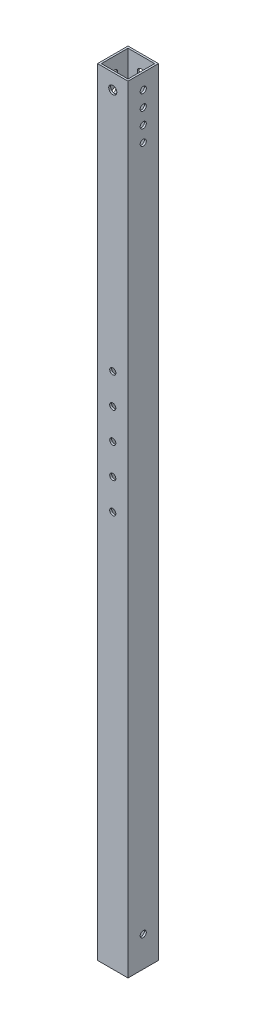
ISO-10303-21;
HEADER;
FILE_DESCRIPTION(('STEP AP214'),'2;1');
FILE_NAME('part.step','',(''),(''),'','','');
FILE_SCHEMA(('AUTOMOTIVE_DESIGN { 1 0 10303 214 1 1 1 1 }'));
ENDSEC;
DATA;
#1=APPLICATION_CONTEXT('core data for automotive mechanical design processes');
#2=APPLICATION_PROTOCOL_DEFINITION('international standard','automotive_design',2000,#1);
#3=PRODUCT_CONTEXT('',#1,'mechanical');
#4=PRODUCT('Part','Part','',(#3));
#5=PRODUCT_RELATED_PRODUCT_CATEGORY('part','',(#4));
#6=PRODUCT_DEFINITION_FORMATION('','',#4);
#7=PRODUCT_DEFINITION_CONTEXT('part definition',#1,'design');
#8=PRODUCT_DEFINITION('design','',#6,#7);
#9=PRODUCT_DEFINITION_SHAPE('','',#8);
#10=(LENGTH_UNIT() NAMED_UNIT(*) SI_UNIT(.MILLI.,.METRE.));
#11=(NAMED_UNIT(*) PLANE_ANGLE_UNIT() SI_UNIT($,.RADIAN.));
#12=(NAMED_UNIT(*) SI_UNIT($,.STERADIAN.) SOLID_ANGLE_UNIT());
#13=UNCERTAINTY_MEASURE_WITH_UNIT(LENGTH_MEASURE(1.E-05),#10,'distance_accuracy_value','');
#14=(GEOMETRIC_REPRESENTATION_CONTEXT(3) GLOBAL_UNCERTAINTY_ASSIGNED_CONTEXT((#13)) GLOBAL_UNIT_ASSIGNED_CONTEXT((#10,
#11,#12)) REPRESENTATION_CONTEXT('',''));
#15=CARTESIAN_POINT('',(0.,0.,0.));
#16=DIRECTION('',(0.,0.,1.));
#17=DIRECTION('',(1.,0.,0.));
#18=AXIS2_PLACEMENT_3D('',#15,#16,#17);
#19=CARTESIAN_POINT('',(-12.7,647.7,12.7));
#20=DIRECTION('',(0.,0.,-1.));
#21=DIRECTION('',(-1.,0.,0.));
#22=AXIS2_PLACEMENT_3D('',#19,#20,#21);
#23=PLANE('',#22);
#24=CARTESIAN_POINT('',(0.,635.,12.7));
#25=DIRECTION('',(0.,0.,-1.));
#26=DIRECTION('',(-1.,0.,0.));
#27=AXIS2_PLACEMENT_3D('',#24,#25,#26);
#28=CIRCLE('',#27,3.373501);
#29=CARTESIAN_POINT('',(-3.373501,635.,12.7));
#30=VERTEX_POINT('',#29);
#31=EDGE_CURVE('E789',#30,#30,#28,.T.);
#32=ORIENTED_EDGE('',*,*,#31,.T.);
#33=EDGE_LOOP('',(#32));
#34=FACE_BOUND('',#33,.T.);
#35=CARTESIAN_POINT('',(0.,330.2,12.7));
#36=DIRECTION('',(0.,0.,1.));
#37=DIRECTION('',(1.,0.,0.));
#38=AXIS2_PLACEMENT_3D('',#35,#36,#37);
#39=CIRCLE('',#38,2.5527);
#40=CARTESIAN_POINT('',(2.5527,330.2,12.7));
#41=VERTEX_POINT('',#40);
#42=EDGE_CURVE('E309',#41,#41,#39,.T.);
#43=ORIENTED_EDGE('',*,*,#42,.F.);
#44=EDGE_LOOP('',(#43));
#45=FACE_BOUND('',#44,.T.);
#46=CARTESIAN_POINT('',(0.,355.6,12.7));
#47=DIRECTION('',(0.,0.,1.));
#48=DIRECTION('',(1.,0.,0.));
#49=AXIS2_PLACEMENT_3D('',#46,#47,#48);
#50=CIRCLE('',#49,2.5527);
#51=CARTESIAN_POINT('',(2.5527,355.6,12.7));
#52=VERTEX_POINT('',#51);
#53=EDGE_CURVE('E319',#52,#52,#50,.T.);
#54=ORIENTED_EDGE('',*,*,#53,.F.);
#55=EDGE_LOOP('',(#54));
#56=FACE_BOUND('',#55,.T.);
#57=CARTESIAN_POINT('',(0.,381.,12.7));
#58=DIRECTION('',(0.,0.,1.));
#59=DIRECTION('',(1.,0.,0.));
#60=AXIS2_PLACEMENT_3D('',#57,#58,#59);
#61=CIRCLE('',#60,2.5527);
#62=CARTESIAN_POINT('',(2.5527,381.,12.7));
#63=VERTEX_POINT('',#62);
#64=EDGE_CURVE('E329',#63,#63,#61,.T.);
#65=ORIENTED_EDGE('',*,*,#64,.F.);
#66=EDGE_LOOP('',(#65));
#67=FACE_BOUND('',#66,.T.);
#68=CARTESIAN_POINT('',(0.,431.8,12.7));
#69=DIRECTION('',(0.,0.,1.));
#70=DIRECTION('',(1.,0.,0.));
#71=AXIS2_PLACEMENT_3D('',#68,#69,#70);
#72=CIRCLE('',#71,2.5527);
#73=CARTESIAN_POINT('',(2.5527,431.8,12.7));
#74=VERTEX_POINT('',#73);
#75=EDGE_CURVE('E349',#74,#74,#72,.T.);
#76=ORIENTED_EDGE('',*,*,#75,.F.);
#77=EDGE_LOOP('',(#76));
#78=FACE_BOUND('',#77,.T.);
#79=DIRECTION('',(1.,0.,0.));
#80=VECTOR('',#79,1.);
#81=CARTESIAN_POINT('',(-12.7,0.,12.7));
#82=LINE('',#81,#80);
#83=CARTESIAN_POINT('',(-12.7,0.,12.7));
#84=VERTEX_POINT('',#83);
#85=CARTESIAN_POINT('',(12.7,0.,12.7));
#86=VERTEX_POINT('',#85);
#87=EDGE_CURVE('E162',#84,#86,#82,.T.);
#88=ORIENTED_EDGE('',*,*,#87,.T.);
#89=DIRECTION('',(0.,-1.,0.));
#90=VECTOR('',#89,1.);
#91=CARTESIAN_POINT('',(12.7,647.7,12.7));
#92=LINE('',#91,#90);
#93=CARTESIAN_POINT('',(12.7,647.7,12.7));
#94=VERTEX_POINT('',#93);
#95=EDGE_CURVE('E171',#94,#86,#92,.T.);
#96=ORIENTED_EDGE('',*,*,#95,.F.);
#97=DIRECTION('',(1.,0.,0.));
#98=VECTOR('',#97,1.);
#99=CARTESIAN_POINT('',(-12.7,647.7,12.7));
#100=LINE('',#99,#98);
#101=CARTESIAN_POINT('',(-12.7,647.7,12.7));
#102=VERTEX_POINT('',#101);
#103=EDGE_CURVE('E168',#102,#94,#100,.T.);
#104=ORIENTED_EDGE('',*,*,#103,.F.);
#105=DIRECTION('',(0.,-1.,0.));
#106=VECTOR('',#105,1.);
#107=CARTESIAN_POINT('',(-12.7,647.7,12.7));
#108=LINE('',#107,#106);
#109=EDGE_CURVE('E186',#102,#84,#108,.T.);
#110=ORIENTED_EDGE('',*,*,#109,.T.);
#111=EDGE_LOOP('',(#88,#96,#104,#110));
#112=FACE_BOUND('',#111,.T.);
#113=CARTESIAN_POINT('',(0.,406.4,12.7));
#114=DIRECTION('',(0.,0.,1.));
#115=DIRECTION('',(1.,0.,0.));
#116=AXIS2_PLACEMENT_3D('',#113,#114,#115);
#117=CIRCLE('',#116,2.5527);
#118=CARTESIAN_POINT('',(2.5527,406.4,12.7));
#119=VERTEX_POINT('',#118);
#120=EDGE_CURVE('E339',#119,#119,#117,.T.);
#121=ORIENTED_EDGE('',*,*,#120,.F.);
#122=EDGE_LOOP('',(#121));
#123=FACE_BOUND('',#122,.T.);
#124=ADVANCED_FACE('F37',(#34,#45,#56,#67,#78,#112,#123),#23,.F.);
#125=CARTESIAN_POINT('',(0.,647.7,0.));
#126=DIRECTION('',(0.,-1.,0.));
#127=DIRECTION('',(0.,0.,-1.));
#128=AXIS2_PLACEMENT_3D('',#125,#126,#127);
#129=PLANE('',#128);
#130=DIRECTION('',(0.,0.,-1.));
#131=VECTOR('',#130,1.);
#132=CARTESIAN_POINT('',(12.7,647.7,12.7));
#133=LINE('',#132,#131);
#134=CARTESIAN_POINT('',(12.7,647.7,-12.7));
#135=VERTEX_POINT('',#134);
#136=EDGE_CURVE('E157',#94,#135,#133,.T.);
#137=ORIENTED_EDGE('',*,*,#136,.T.);
#138=DIRECTION('',(-1.,0.,0.));
#139=VECTOR('',#138,1.);
#140=CARTESIAN_POINT('',(-12.7,647.7,-12.7));
#141=LINE('',#140,#139);
#142=CARTESIAN_POINT('',(-12.7,647.7,-12.7));
#143=VERTEX_POINT('',#142);
#144=EDGE_CURVE('E161',#135,#143,#141,.T.);
#145=ORIENTED_EDGE('',*,*,#144,.T.);
#146=DIRECTION('',(0.,0.,1.));
#147=VECTOR('',#146,1.);
#148=CARTESIAN_POINT('',(-12.7,647.7,12.7));
#149=LINE('',#148,#147);
#150=EDGE_CURVE('E165',#143,#102,#149,.T.);
#151=ORIENTED_EDGE('',*,*,#150,.T.);
#152=ORIENTED_EDGE('',*,*,#103,.T.);
#153=EDGE_LOOP('',(#137,#145,#151,#152));
#154=FACE_BOUND('',#153,.T.);
#155=DIRECTION('',(0.,0.,-1.));
#156=VECTOR('',#155,1.);
#157=CARTESIAN_POINT('',(11.1125,647.7,11.1125));
#158=LINE('',#157,#156);
#159=CARTESIAN_POINT('',(11.1125,647.7,11.1125));
#160=VERTEX_POINT('',#159);
#161=CARTESIAN_POINT('',(11.1125,647.7,-11.1125));
#162=VERTEX_POINT('',#161);
#163=EDGE_CURVE('E105',#160,#162,#158,.T.);
#164=ORIENTED_EDGE('',*,*,#163,.F.);
#165=DIRECTION('',(1.,0.,0.));
#166=VECTOR('',#165,1.);
#167=CARTESIAN_POINT('',(-11.1125,647.7,11.1125));
#168=LINE('',#167,#166);
#169=CARTESIAN_POINT('',(-11.1125,647.7,11.1125));
#170=VERTEX_POINT('',#169);
#171=EDGE_CURVE('E133',#170,#160,#168,.T.);
#172=ORIENTED_EDGE('',*,*,#171,.F.);
#173=DIRECTION('',(0.,0.,1.));
#174=VECTOR('',#173,1.);
#175=CARTESIAN_POINT('',(-11.1125,647.7,11.1125));
#176=LINE('',#175,#174);
#177=CARTESIAN_POINT('',(-11.1125,647.7,-11.1125));
#178=VERTEX_POINT('',#177);
#179=EDGE_CURVE('E128',#178,#170,#176,.T.);
#180=ORIENTED_EDGE('',*,*,#179,.F.);
#181=DIRECTION('',(-1.,0.,0.));
#182=VECTOR('',#181,1.);
#183=CARTESIAN_POINT('',(-11.1125,647.7,-11.1125));
#184=LINE('',#183,#182);
#185=EDGE_CURVE('E114',#162,#178,#184,.T.);
#186=ORIENTED_EDGE('',*,*,#185,.F.);
#187=EDGE_LOOP('',(#164,#172,#180,#186));
#188=FACE_BOUND('',#187,.T.);
#189=ADVANCED_FACE('F127',(#154,#188),#129,.F.);
#190=CARTESIAN_POINT('',(0.,0.,0.));
#191=DIRECTION('',(0.,-1.,0.));
#192=DIRECTION('',(0.,0.,-1.));
#193=AXIS2_PLACEMENT_3D('',#190,#191,#192);
#194=PLANE('',#193);
#195=DIRECTION('',(0.,0.,-1.));
#196=VECTOR('',#195,1.);
#197=CARTESIAN_POINT('',(12.7,0.,12.7));
#198=LINE('',#197,#196);
#199=CARTESIAN_POINT('',(12.7,0.,-12.7));
#200=VERTEX_POINT('',#199);
#201=EDGE_CURVE('E123',#86,#200,#198,.T.);
#202=ORIENTED_EDGE('',*,*,#201,.F.);
#203=ORIENTED_EDGE('',*,*,#87,.F.);
#204=DIRECTION('',(0.,0.,1.));
#205=VECTOR('',#204,1.);
#206=CARTESIAN_POINT('',(-12.7,0.,12.7));
#207=LINE('',#206,#205);
#208=CARTESIAN_POINT('',(-12.7,0.,-12.7));
#209=VERTEX_POINT('',#208);
#210=EDGE_CURVE('E178',#209,#84,#207,.T.);
#211=ORIENTED_EDGE('',*,*,#210,.F.);
#212=DIRECTION('',(-1.,0.,0.));
#213=VECTOR('',#212,1.);
#214=CARTESIAN_POINT('',(-12.7,0.,-12.7));
#215=LINE('',#214,#213);
#216=EDGE_CURVE('E175',#200,#209,#215,.T.);
#217=ORIENTED_EDGE('',*,*,#216,.F.);
#218=EDGE_LOOP('',(#202,#203,#211,#217));
#219=FACE_BOUND('',#218,.T.);
#220=DIRECTION('',(1.,0.,0.));
#221=VECTOR('',#220,1.);
#222=CARTESIAN_POINT('',(-11.1125,0.,11.1125));
#223=LINE('',#222,#221);
#224=CARTESIAN_POINT('',(-11.1125,0.,11.1125));
#225=VERTEX_POINT('',#224);
#226=CARTESIAN_POINT('',(11.1125,0.,11.1125));
#227=VERTEX_POINT('',#226);
#228=EDGE_CURVE('E115',#225,#227,#223,.T.);
#229=ORIENTED_EDGE('',*,*,#228,.T.);
#230=DIRECTION('',(0.,0.,-1.));
#231=VECTOR('',#230,1.);
#232=CARTESIAN_POINT('',(11.1125,0.,11.1125));
#233=LINE('',#232,#231);
#234=CARTESIAN_POINT('',(11.1125,0.,-11.1125));
#235=VERTEX_POINT('',#234);
#236=EDGE_CURVE('E63',#227,#235,#233,.T.);
#237=ORIENTED_EDGE('',*,*,#236,.T.);
#238=DIRECTION('',(-1.,0.,0.));
#239=VECTOR('',#238,1.);
#240=CARTESIAN_POINT('',(-11.1125,0.,-11.1125));
#241=LINE('',#240,#239);
#242=CARTESIAN_POINT('',(-11.1125,0.,-11.1125));
#243=VERTEX_POINT('',#242);
#244=EDGE_CURVE('E121',#235,#243,#241,.T.);
#245=ORIENTED_EDGE('',*,*,#244,.T.);
#246=DIRECTION('',(0.,0.,1.));
#247=VECTOR('',#246,1.);
#248=CARTESIAN_POINT('',(-11.1125,0.,11.1125));
#249=LINE('',#248,#247);
#250=EDGE_CURVE('E144',#243,#225,#249,.T.);
#251=ORIENTED_EDGE('',*,*,#250,.T.);
#252=EDGE_LOOP('',(#229,#237,#245,#251));
#253=FACE_BOUND('',#252,.T.);
#254=ADVANCED_FACE('F371',(#219,#253),#194,.T.);
#255=CARTESIAN_POINT('',(12.7,647.7,12.7));
#256=DIRECTION('',(-1.,0.,0.));
#257=DIRECTION('',(0.,0.,1.));
#258=AXIS2_PLACEMENT_3D('',#255,#256,#257);
#259=PLANE('',#258);
#260=CARTESIAN_POINT('',(12.7,635.,0.));
#261=DIRECTION('',(1.,0.,0.));
#262=DIRECTION('',(0.,0.,-1.));
#263=AXIS2_PLACEMENT_3D('',#260,#261,#262);
#264=CIRCLE('',#263,2.55269999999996);
#265=CARTESIAN_POINT('',(12.7,635.,-2.55269999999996));
#266=VERTEX_POINT('',#265);
#267=EDGE_CURVE('E259',#266,#266,#264,.T.);
#268=ORIENTED_EDGE('',*,*,#267,.F.);
#269=EDGE_LOOP('',(#268));
#270=FACE_BOUND('',#269,.T.);
#271=CARTESIAN_POINT('',(12.7,622.3,0.));
#272=DIRECTION('',(1.,0.,0.));
#273=DIRECTION('',(0.,0.,-1.));
#274=AXIS2_PLACEMENT_3D('',#271,#272,#273);
#275=CIRCLE('',#274,2.55269999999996);
#276=CARTESIAN_POINT('',(12.7,622.3,-2.55269999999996));
#277=VERTEX_POINT('',#276);
#278=EDGE_CURVE('E256',#277,#277,#275,.T.);
#279=ORIENTED_EDGE('',*,*,#278,.F.);
#280=EDGE_LOOP('',(#279));
#281=FACE_BOUND('',#280,.T.);
#282=CARTESIAN_POINT('',(12.7,609.6,0.));
#283=DIRECTION('',(1.,0.,0.));
#284=DIRECTION('',(0.,0.,-1.));
#285=AXIS2_PLACEMENT_3D('',#282,#283,#284);
#286=CIRCLE('',#285,2.55269999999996);
#287=CARTESIAN_POINT('',(12.7,609.6,-2.55269999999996));
#288=VERTEX_POINT('',#287);
#289=EDGE_CURVE('E279',#288,#288,#286,.T.);
#290=ORIENTED_EDGE('',*,*,#289,.F.);
#291=EDGE_LOOP('',(#290));
#292=FACE_BOUND('',#291,.T.);
#293=CARTESIAN_POINT('',(12.7,596.9,0.));
#294=DIRECTION('',(1.,0.,0.));
#295=DIRECTION('',(0.,0.,-1.));
#296=AXIS2_PLACEMENT_3D('',#293,#294,#295);
#297=CIRCLE('',#296,2.55269999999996);
#298=CARTESIAN_POINT('',(12.7,596.9,-2.55269999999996));
#299=VERTEX_POINT('',#298);
#300=EDGE_CURVE('E289',#299,#299,#297,.T.);
#301=ORIENTED_EDGE('',*,*,#300,.F.);
#302=EDGE_LOOP('',(#301));
#303=FACE_BOUND('',#302,.T.);
#304=CARTESIAN_POINT('',(12.7,25.4,0.));
#305=DIRECTION('',(1.,0.,0.));
#306=DIRECTION('',(0.,0.,-1.));
#307=AXIS2_PLACEMENT_3D('',#304,#305,#306);
#308=CIRCLE('',#307,2.55269999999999);
#309=CARTESIAN_POINT('',(12.7,25.4,-2.55269999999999));
#310=VERTEX_POINT('',#309);
#311=EDGE_CURVE('E299',#310,#310,#308,.T.);
#312=ORIENTED_EDGE('',*,*,#311,.F.);
#313=EDGE_LOOP('',(#312));
#314=FACE_BOUND('',#313,.T.);
#315=ORIENTED_EDGE('',*,*,#201,.T.);
#316=DIRECTION('',(0.,-1.,0.));
#317=VECTOR('',#316,1.);
#318=CARTESIAN_POINT('',(12.7,647.7,-12.7));
#319=LINE('',#318,#317);
#320=EDGE_CURVE('E11',#135,#200,#319,.T.);
#321=ORIENTED_EDGE('',*,*,#320,.F.);
#322=ORIENTED_EDGE('',*,*,#136,.F.);
#323=ORIENTED_EDGE('',*,*,#95,.T.);
#324=EDGE_LOOP('',(#315,#321,#322,#323));
#325=FACE_BOUND('',#324,.T.);
#326=ADVANCED_FACE('F39',(#270,#281,#292,#303,#314,#325),#259,.F.);
#327=CARTESIAN_POINT('',(-12.7,647.7,-12.7));
#328=DIRECTION('',(0.,0.,1.));
#329=DIRECTION('',(1.,0.,0.));
#330=AXIS2_PLACEMENT_3D('',#327,#328,#329);
#331=PLANE('',#330);
#332=CARTESIAN_POINT('',(0.,635.,-12.7));
#333=DIRECTION('',(0.,0.,-1.));
#334=DIRECTION('',(-1.,0.,0.));
#335=AXIS2_PLACEMENT_3D('',#332,#333,#334);
#336=CIRCLE('',#335,3.37350099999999);
#337=CARTESIAN_POINT('',(-3.37350099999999,635.,-12.7));
#338=VERTEX_POINT('',#337);
#339=EDGE_CURVE('E407',#338,#338,#336,.T.);
#340=ORIENTED_EDGE('',*,*,#339,.F.);
#341=EDGE_LOOP('',(#340));
#342=FACE_BOUND('',#341,.T.);
#343=CARTESIAN_POINT('',(0.,330.2,-12.7));
#344=DIRECTION('',(0.,0.,1.));
#345=DIRECTION('',(1.,0.,0.));
#346=AXIS2_PLACEMENT_3D('',#343,#344,#345);
#347=CIRCLE('',#346,2.55269999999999);
#348=CARTESIAN_POINT('',(2.55269999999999,330.2,-12.7));
#349=VERTEX_POINT('',#348);
#350=EDGE_CURVE('E221',#349,#349,#347,.T.);
#351=ORIENTED_EDGE('',*,*,#350,.T.);
#352=EDGE_LOOP('',(#351));
#353=FACE_BOUND('',#352,.T.);
#354=CARTESIAN_POINT('',(0.,355.6,-12.7));
#355=DIRECTION('',(0.,0.,1.));
#356=DIRECTION('',(1.,0.,0.));
#357=AXIS2_PLACEMENT_3D('',#354,#355,#356);
#358=CIRCLE('',#357,2.55269999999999);
#359=CARTESIAN_POINT('',(2.55269999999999,355.6,-12.7));
#360=VERTEX_POINT('',#359);
#361=EDGE_CURVE('E215',#360,#360,#358,.T.);
#362=ORIENTED_EDGE('',*,*,#361,.T.);
#363=EDGE_LOOP('',(#362));
#364=FACE_BOUND('',#363,.T.);
#365=CARTESIAN_POINT('',(0.,381.,-12.7));
#366=DIRECTION('',(0.,0.,1.));
#367=DIRECTION('',(1.,0.,0.));
#368=AXIS2_PLACEMENT_3D('',#365,#366,#367);
#369=CIRCLE('',#368,2.55269999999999);
#370=CARTESIAN_POINT('',(2.55269999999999,381.,-12.7));
#371=VERTEX_POINT('',#370);
#372=EDGE_CURVE('E209',#371,#371,#369,.T.);
#373=ORIENTED_EDGE('',*,*,#372,.T.);
#374=EDGE_LOOP('',(#373));
#375=FACE_BOUND('',#374,.T.);
#376=CARTESIAN_POINT('',(0.,406.4,-12.7));
#377=DIRECTION('',(0.,0.,1.));
#378=DIRECTION('',(1.,0.,0.));
#379=AXIS2_PLACEMENT_3D('',#376,#377,#378);
#380=CIRCLE('',#379,2.55269999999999);
#381=CARTESIAN_POINT('',(2.55269999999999,406.4,-12.7));
#382=VERTEX_POINT('',#381);
#383=EDGE_CURVE('E203',#382,#382,#380,.T.);
#384=ORIENTED_EDGE('',*,*,#383,.T.);
#385=EDGE_LOOP('',(#384));
#386=FACE_BOUND('',#385,.T.);
#387=CARTESIAN_POINT('',(0.,431.8,-12.7));
#388=DIRECTION('',(0.,0.,1.));
#389=DIRECTION('',(1.,0.,0.));
#390=AXIS2_PLACEMENT_3D('',#387,#388,#389);
#391=CIRCLE('',#390,2.55269999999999);
#392=CARTESIAN_POINT('',(2.55269999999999,431.8,-12.7));
#393=VERTEX_POINT('',#392);
#394=EDGE_CURVE('E197',#393,#393,#391,.T.);
#395=ORIENTED_EDGE('',*,*,#394,.T.);
#396=EDGE_LOOP('',(#395));
#397=FACE_BOUND('',#396,.T.);
#398=ORIENTED_EDGE('',*,*,#216,.T.);
#399=DIRECTION('',(0.,-1.,0.));
#400=VECTOR('',#399,1.);
#401=CARTESIAN_POINT('',(-12.7,647.7,-12.7));
#402=LINE('',#401,#400);
#403=EDGE_CURVE('E47',#143,#209,#402,.T.);
#404=ORIENTED_EDGE('',*,*,#403,.F.);
#405=ORIENTED_EDGE('',*,*,#144,.F.);
#406=ORIENTED_EDGE('',*,*,#320,.T.);
#407=EDGE_LOOP('',(#398,#404,#405,#406));
#408=FACE_BOUND('',#407,.T.);
#409=ADVANCED_FACE('F397',(#342,#353,#364,#375,#386,#397,#408),#331,.F.);
#410=CARTESIAN_POINT('',(-12.7,647.7,12.7));
#411=DIRECTION('',(1.,0.,0.));
#412=DIRECTION('',(0.,0.,-1.));
#413=AXIS2_PLACEMENT_3D('',#410,#411,#412);
#414=PLANE('',#413);
#415=CARTESIAN_POINT('',(-12.7,635.,0.));
#416=DIRECTION('',(1.,0.,0.));
#417=DIRECTION('',(0.,0.,-1.));
#418=AXIS2_PLACEMENT_3D('',#415,#416,#417);
#419=CIRCLE('',#418,2.55269999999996);
#420=CARTESIAN_POINT('',(-12.7,635.,-2.55269999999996));
#421=VERTEX_POINT('',#420);
#422=EDGE_CURVE('E249',#421,#421,#419,.T.);
#423=ORIENTED_EDGE('',*,*,#422,.T.);
#424=EDGE_LOOP('',(#423));
#425=FACE_BOUND('',#424,.T.);
#426=CARTESIAN_POINT('',(-12.7,622.3,0.));
#427=DIRECTION('',(1.,0.,0.));
#428=DIRECTION('',(0.,0.,-1.));
#429=AXIS2_PLACEMENT_3D('',#426,#427,#428);
#430=CIRCLE('',#429,2.55269999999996);
#431=CARTESIAN_POINT('',(-12.7,622.3,-2.55269999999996));
#432=VERTEX_POINT('',#431);
#433=EDGE_CURVE('E244',#432,#432,#430,.T.);
#434=ORIENTED_EDGE('',*,*,#433,.T.);
#435=EDGE_LOOP('',(#434));
#436=FACE_BOUND('',#435,.T.);
#437=CARTESIAN_POINT('',(-12.7,609.6,0.));
#438=DIRECTION('',(1.,0.,0.));
#439=DIRECTION('',(0.,0.,-1.));
#440=AXIS2_PLACEMENT_3D('',#437,#438,#439);
#441=CIRCLE('',#440,2.55269999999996);
#442=CARTESIAN_POINT('',(-12.7,609.6,-2.55269999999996));
#443=VERTEX_POINT('',#442);
#444=EDGE_CURVE('E239',#443,#443,#441,.T.);
#445=ORIENTED_EDGE('',*,*,#444,.T.);
#446=EDGE_LOOP('',(#445));
#447=FACE_BOUND('',#446,.T.);
#448=CARTESIAN_POINT('',(-12.7,596.9,0.));
#449=DIRECTION('',(1.,0.,0.));
#450=DIRECTION('',(0.,0.,-1.));
#451=AXIS2_PLACEMENT_3D('',#448,#449,#450);
#452=CIRCLE('',#451,2.55269999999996);
#453=CARTESIAN_POINT('',(-12.7,596.9,-2.55269999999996));
#454=VERTEX_POINT('',#453);
#455=EDGE_CURVE('E233',#454,#454,#452,.T.);
#456=ORIENTED_EDGE('',*,*,#455,.T.);
#457=EDGE_LOOP('',(#456));
#458=FACE_BOUND('',#457,.T.);
#459=CARTESIAN_POINT('',(-12.7,25.4,0.));
#460=DIRECTION('',(1.,0.,0.));
#461=DIRECTION('',(0.,0.,-1.));
#462=AXIS2_PLACEMENT_3D('',#459,#460,#461);
#463=CIRCLE('',#462,2.55269999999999);
#464=CARTESIAN_POINT('',(-12.7,25.4,-2.55269999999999));
#465=VERTEX_POINT('',#464);
#466=EDGE_CURVE('E227',#465,#465,#463,.T.);
#467=ORIENTED_EDGE('',*,*,#466,.T.);
#468=EDGE_LOOP('',(#467));
#469=FACE_BOUND('',#468,.T.);
#470=ORIENTED_EDGE('',*,*,#210,.T.);
#471=ORIENTED_EDGE('',*,*,#109,.F.);
#472=ORIENTED_EDGE('',*,*,#150,.F.);
#473=ORIENTED_EDGE('',*,*,#403,.T.);
#474=EDGE_LOOP('',(#470,#471,#472,#473));
#475=FACE_BOUND('',#474,.T.);
#476=ADVANCED_FACE('F395',(#425,#436,#447,#458,#469,#475),#414,.F.);
#477=CARTESIAN_POINT('',(11.1125,647.7,11.1125));
#478=DIRECTION('',(-1.,0.,0.));
#479=DIRECTION('',(0.,0.,1.));
#480=AXIS2_PLACEMENT_3D('',#477,#478,#479);
#481=PLANE('',#480);
#482=CARTESIAN_POINT('',(11.1125,635.,0.));
#483=DIRECTION('',(-1.,0.,0.));
#484=DIRECTION('',(0.,0.,1.));
#485=AXIS2_PLACEMENT_3D('',#482,#483,#484);
#486=CIRCLE('',#485,2.55269999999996);
#487=CARTESIAN_POINT('',(11.1125,635.,2.55269999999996));
#488=VERTEX_POINT('',#487);
#489=EDGE_CURVE('E245',#488,#488,#486,.T.);
#490=ORIENTED_EDGE('',*,*,#489,.F.);
#491=EDGE_LOOP('',(#490));
#492=FACE_BOUND('',#491,.T.);
#493=CARTESIAN_POINT('',(11.1125,622.3,0.));
#494=DIRECTION('',(-1.,0.,0.));
#495=DIRECTION('',(0.,0.,1.));
#496=AXIS2_PLACEMENT_3D('',#493,#494,#495);
#497=CIRCLE('',#496,2.55269999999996);
#498=CARTESIAN_POINT('',(11.1125,622.3,2.55269999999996));
#499=VERTEX_POINT('',#498);
#500=EDGE_CURVE('E243',#499,#499,#497,.T.);
#501=ORIENTED_EDGE('',*,*,#500,.F.);
#502=EDGE_LOOP('',(#501));
#503=FACE_BOUND('',#502,.T.);
#504=CARTESIAN_POINT('',(11.1125,609.6,0.));
#505=DIRECTION('',(-1.,0.,0.));
#506=DIRECTION('',(0.,0.,1.));
#507=AXIS2_PLACEMENT_3D('',#504,#505,#506);
#508=CIRCLE('',#507,2.55269999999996);
#509=CARTESIAN_POINT('',(11.1125,609.6,2.55269999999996));
#510=VERTEX_POINT('',#509);
#511=EDGE_CURVE('E234',#510,#510,#508,.T.);
#512=ORIENTED_EDGE('',*,*,#511,.F.);
#513=EDGE_LOOP('',(#512));
#514=FACE_BOUND('',#513,.T.);
#515=CARTESIAN_POINT('',(11.1125,596.9,0.));
#516=DIRECTION('',(-1.,0.,0.));
#517=DIRECTION('',(0.,0.,1.));
#518=AXIS2_PLACEMENT_3D('',#515,#516,#517);
#519=CIRCLE('',#518,2.55269999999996);
#520=CARTESIAN_POINT('',(11.1125,596.9,2.55269999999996));
#521=VERTEX_POINT('',#520);
#522=EDGE_CURVE('E232',#521,#521,#519,.T.);
#523=ORIENTED_EDGE('',*,*,#522,.F.);
#524=EDGE_LOOP('',(#523));
#525=FACE_BOUND('',#524,.T.);
#526=CARTESIAN_POINT('',(11.1125,25.4,0.));
#527=DIRECTION('',(-1.,0.,0.));
#528=DIRECTION('',(0.,0.,1.));
#529=AXIS2_PLACEMENT_3D('',#526,#527,#528);
#530=CIRCLE('',#529,2.55269999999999);
#531=CARTESIAN_POINT('',(11.1125,25.4,2.55269999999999));
#532=VERTEX_POINT('',#531);
#533=EDGE_CURVE('E222',#532,#532,#530,.T.);
#534=ORIENTED_EDGE('',*,*,#533,.F.);
#535=EDGE_LOOP('',(#534));
#536=FACE_BOUND('',#535,.T.);
#537=ORIENTED_EDGE('',*,*,#236,.F.);
#538=DIRECTION('',(0.,-1.,0.));
#539=VECTOR('',#538,1.);
#540=CARTESIAN_POINT('',(11.1125,647.7,11.1125));
#541=LINE('',#540,#539);
#542=EDGE_CURVE('E109',#160,#227,#541,.T.);
#543=ORIENTED_EDGE('',*,*,#542,.F.);
#544=ORIENTED_EDGE('',*,*,#163,.T.);
#545=DIRECTION('',(0.,-1.,0.));
#546=VECTOR('',#545,1.);
#547=CARTESIAN_POINT('',(11.1125,647.7,-11.1125));
#548=LINE('',#547,#546);
#549=EDGE_CURVE('E108',#162,#235,#548,.T.);
#550=ORIENTED_EDGE('',*,*,#549,.T.);
#551=EDGE_LOOP('',(#537,#543,#544,#550));
#552=FACE_BOUND('',#551,.T.);
#553=ADVANCED_FACE('F107',(#492,#503,#514,#525,#536,#552),#481,.T.);
#554=CARTESIAN_POINT('',(-11.1125,647.7,-11.1125));
#555=DIRECTION('',(0.,0.,1.));
#556=DIRECTION('',(1.,0.,0.));
#557=AXIS2_PLACEMENT_3D('',#554,#555,#556);
#558=PLANE('',#557);
#559=CARTESIAN_POINT('',(0.,635.,-11.1125));
#560=DIRECTION('',(0.,0.,1.));
#561=DIRECTION('',(1.,0.,0.));
#562=AXIS2_PLACEMENT_3D('',#559,#560,#561);
#563=CIRCLE('',#562,3.37350099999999);
#564=CARTESIAN_POINT('',(3.37350099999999,635.,-11.1125));
#565=VERTEX_POINT('',#564);
#566=EDGE_CURVE('E266',#565,#565,#563,.T.);
#567=ORIENTED_EDGE('',*,*,#566,.F.);
#568=EDGE_LOOP('',(#567));
#569=FACE_BOUND('',#568,.T.);
#570=CARTESIAN_POINT('',(0.,330.2,-11.1125));
#571=DIRECTION('',(0.,0.,1.));
#572=DIRECTION('',(1.,0.,0.));
#573=AXIS2_PLACEMENT_3D('',#570,#571,#572);
#574=CIRCLE('',#573,2.55269999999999);
#575=CARTESIAN_POINT('',(2.5527,330.2,-11.1125));
#576=VERTEX_POINT('',#575);
#577=EDGE_CURVE('E220',#576,#576,#574,.T.);
#578=ORIENTED_EDGE('',*,*,#577,.F.);
#579=EDGE_LOOP('',(#578));
#580=FACE_BOUND('',#579,.T.);
#581=CARTESIAN_POINT('',(0.,355.6,-11.1125));
#582=DIRECTION('',(0.,0.,1.));
#583=DIRECTION('',(1.,0.,0.));
#584=AXIS2_PLACEMENT_3D('',#581,#582,#583);
#585=CIRCLE('',#584,2.55269999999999);
#586=CARTESIAN_POINT('',(2.5527,355.6,-11.1125));
#587=VERTEX_POINT('',#586);
#588=EDGE_CURVE('E214',#587,#587,#585,.T.);
#589=ORIENTED_EDGE('',*,*,#588,.F.);
#590=EDGE_LOOP('',(#589));
#591=FACE_BOUND('',#590,.T.);
#592=CARTESIAN_POINT('',(0.,381.,-11.1125));
#593=DIRECTION('',(0.,0.,1.));
#594=DIRECTION('',(1.,0.,0.));
#595=AXIS2_PLACEMENT_3D('',#592,#593,#594);
#596=CIRCLE('',#595,2.55269999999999);
#597=CARTESIAN_POINT('',(2.5527,381.,-11.1125));
#598=VERTEX_POINT('',#597);
#599=EDGE_CURVE('E208',#598,#598,#596,.T.);
#600=ORIENTED_EDGE('',*,*,#599,.F.);
#601=EDGE_LOOP('',(#600));
#602=FACE_BOUND('',#601,.T.);
#603=CARTESIAN_POINT('',(0.,406.4,-11.1125));
#604=DIRECTION('',(0.,0.,1.));
#605=DIRECTION('',(1.,0.,0.));
#606=AXIS2_PLACEMENT_3D('',#603,#604,#605);
#607=CIRCLE('',#606,2.55269999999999);
#608=CARTESIAN_POINT('',(2.5527,406.4,-11.1125));
#609=VERTEX_POINT('',#608);
#610=EDGE_CURVE('E202',#609,#609,#607,.T.);
#611=ORIENTED_EDGE('',*,*,#610,.F.);
#612=EDGE_LOOP('',(#611));
#613=FACE_BOUND('',#612,.T.);
#614=CARTESIAN_POINT('',(0.,431.8,-11.1125));
#615=DIRECTION('',(0.,0.,1.));
#616=DIRECTION('',(1.,0.,0.));
#617=AXIS2_PLACEMENT_3D('',#614,#615,#616);
#618=CIRCLE('',#617,2.55269999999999);
#619=CARTESIAN_POINT('',(2.5527,431.8,-11.1125));
#620=VERTEX_POINT('',#619);
#621=EDGE_CURVE('E193',#620,#620,#618,.T.);
#622=ORIENTED_EDGE('',*,*,#621,.F.);
#623=EDGE_LOOP('',(#622));
#624=FACE_BOUND('',#623,.T.);
#625=ORIENTED_EDGE('',*,*,#244,.F.);
#626=ORIENTED_EDGE('',*,*,#549,.F.);
#627=ORIENTED_EDGE('',*,*,#185,.T.);
#628=DIRECTION('',(0.,-1.,0.));
#629=VECTOR('',#628,1.);
#630=CARTESIAN_POINT('',(-11.1125,647.7,-11.1125));
#631=LINE('',#630,#629);
#632=EDGE_CURVE('E124',#178,#243,#631,.T.);
#633=ORIENTED_EDGE('',*,*,#632,.T.);
#634=EDGE_LOOP('',(#625,#626,#627,#633));
#635=FACE_BOUND('',#634,.T.);
#636=ADVANCED_FACE('F118',(#569,#580,#591,#602,#613,#624,#635),#558,.T.);
#637=CARTESIAN_POINT('',(-11.1125,647.7,11.1125));
#638=DIRECTION('',(1.,0.,0.));
#639=DIRECTION('',(0.,0.,-1.));
#640=AXIS2_PLACEMENT_3D('',#637,#638,#639);
#641=PLANE('',#640);
#642=CARTESIAN_POINT('',(-11.1125,635.,0.));
#643=DIRECTION('',(1.,0.,0.));
#644=DIRECTION('',(0.,0.,-1.));
#645=AXIS2_PLACEMENT_3D('',#642,#643,#644);
#646=CIRCLE('',#645,2.55269999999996);
#647=CARTESIAN_POINT('',(-11.1125,635.,-2.55269999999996));
#648=VERTEX_POINT('',#647);
#649=EDGE_CURVE('E248',#648,#648,#646,.T.);
#650=ORIENTED_EDGE('',*,*,#649,.F.);
#651=EDGE_LOOP('',(#650));
#652=FACE_BOUND('',#651,.T.);
#653=CARTESIAN_POINT('',(-11.1125,622.3,0.));
#654=DIRECTION('',(1.,0.,0.));
#655=DIRECTION('',(0.,0.,-1.));
#656=AXIS2_PLACEMENT_3D('',#653,#654,#655);
#657=CIRCLE('',#656,2.55269999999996);
#658=CARTESIAN_POINT('',(-11.1125,622.3,-2.55269999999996));
#659=VERTEX_POINT('',#658);
#660=EDGE_CURVE('E240',#659,#659,#657,.T.);
#661=ORIENTED_EDGE('',*,*,#660,.F.);
#662=EDGE_LOOP('',(#661));
#663=FACE_BOUND('',#662,.T.);
#664=CARTESIAN_POINT('',(-11.1125,609.6,0.));
#665=DIRECTION('',(1.,0.,0.));
#666=DIRECTION('',(0.,0.,-1.));
#667=AXIS2_PLACEMENT_3D('',#664,#665,#666);
#668=CIRCLE('',#667,2.55269999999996);
#669=CARTESIAN_POINT('',(-11.1125,609.6,-2.55269999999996));
#670=VERTEX_POINT('',#669);
#671=EDGE_CURVE('E238',#670,#670,#668,.T.);
#672=ORIENTED_EDGE('',*,*,#671,.F.);
#673=EDGE_LOOP('',(#672));
#674=FACE_BOUND('',#673,.T.);
#675=CARTESIAN_POINT('',(-11.1125,596.9,0.));
#676=DIRECTION('',(1.,0.,0.));
#677=DIRECTION('',(0.,0.,-1.));
#678=AXIS2_PLACEMENT_3D('',#675,#676,#677);
#679=CIRCLE('',#678,2.55269999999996);
#680=CARTESIAN_POINT('',(-11.1125,596.9,-2.55269999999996));
#681=VERTEX_POINT('',#680);
#682=EDGE_CURVE('E228',#681,#681,#679,.T.);
#683=ORIENTED_EDGE('',*,*,#682,.F.);
#684=EDGE_LOOP('',(#683));
#685=FACE_BOUND('',#684,.T.);
#686=CARTESIAN_POINT('',(-11.1125,25.4,0.));
#687=DIRECTION('',(1.,0.,0.));
#688=DIRECTION('',(0.,0.,-1.));
#689=AXIS2_PLACEMENT_3D('',#686,#687,#688);
#690=CIRCLE('',#689,2.55269999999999);
#691=CARTESIAN_POINT('',(-11.1125,25.4,-2.55269999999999));
#692=VERTEX_POINT('',#691);
#693=EDGE_CURVE('E226',#692,#692,#690,.T.);
#694=ORIENTED_EDGE('',*,*,#693,.F.);
#695=EDGE_LOOP('',(#694));
#696=FACE_BOUND('',#695,.T.);
#697=ORIENTED_EDGE('',*,*,#250,.F.);
#698=ORIENTED_EDGE('',*,*,#632,.F.);
#699=ORIENTED_EDGE('',*,*,#179,.T.);
#700=DIRECTION('',(0.,-1.,0.));
#701=VECTOR('',#700,1.);
#702=CARTESIAN_POINT('',(-11.1125,647.7,11.1125));
#703=LINE('',#702,#701);
#704=EDGE_CURVE('E55',#170,#225,#703,.T.);
#705=ORIENTED_EDGE('',*,*,#704,.T.);
#706=EDGE_LOOP('',(#697,#698,#699,#705));
#707=FACE_BOUND('',#706,.T.);
#708=ADVANCED_FACE('F366',(#652,#663,#674,#685,#696,#707),#641,.T.);
#709=CARTESIAN_POINT('',(-11.1125,647.7,11.1125));
#710=DIRECTION('',(0.,0.,-1.));
#711=DIRECTION('',(-1.,0.,0.));
#712=AXIS2_PLACEMENT_3D('',#709,#710,#711);
#713=PLANE('',#712);
#714=CARTESIAN_POINT('',(0.,635.,11.1125));
#715=DIRECTION('',(0.,0.,-1.));
#716=DIRECTION('',(-1.,0.,0.));
#717=AXIS2_PLACEMENT_3D('',#714,#715,#716);
#718=CIRCLE('',#717,3.37350099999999);
#719=CARTESIAN_POINT('',(-3.37350099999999,635.,11.1125));
#720=VERTEX_POINT('',#719);
#721=EDGE_CURVE('E41',#720,#720,#718,.T.);
#722=ORIENTED_EDGE('',*,*,#721,.F.);
#723=EDGE_LOOP('',(#722));
#724=FACE_BOUND('',#723,.T.);
#725=CARTESIAN_POINT('',(0.,330.2,11.1125));
#726=DIRECTION('',(0.,0.,-1.));
#727=DIRECTION('',(-1.,0.,0.));
#728=AXIS2_PLACEMENT_3D('',#725,#726,#727);
#729=CIRCLE('',#728,2.55269999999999);
#730=CARTESIAN_POINT('',(-2.55269999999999,330.2,11.1125));
#731=VERTEX_POINT('',#730);
#732=EDGE_CURVE('E216',#731,#731,#729,.T.);
#733=ORIENTED_EDGE('',*,*,#732,.F.);
#734=EDGE_LOOP('',(#733));
#735=FACE_BOUND('',#734,.T.);
#736=CARTESIAN_POINT('',(0.,355.6,11.1125));
#737=DIRECTION('',(0.,0.,-1.));
#738=DIRECTION('',(-1.,0.,0.));
#739=AXIS2_PLACEMENT_3D('',#736,#737,#738);
#740=CIRCLE('',#739,2.55269999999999);
#741=CARTESIAN_POINT('',(-2.55269999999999,355.6,11.1125));
#742=VERTEX_POINT('',#741);
#743=EDGE_CURVE('E210',#742,#742,#740,.T.);
#744=ORIENTED_EDGE('',*,*,#743,.F.);
#745=EDGE_LOOP('',(#744));
#746=FACE_BOUND('',#745,.T.);
#747=CARTESIAN_POINT('',(0.,381.,11.1125));
#748=DIRECTION('',(0.,0.,-1.));
#749=DIRECTION('',(-1.,0.,0.));
#750=AXIS2_PLACEMENT_3D('',#747,#748,#749);
#751=CIRCLE('',#750,2.55269999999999);
#752=CARTESIAN_POINT('',(-2.55269999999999,381.,11.1125));
#753=VERTEX_POINT('',#752);
#754=EDGE_CURVE('E204',#753,#753,#751,.T.);
#755=ORIENTED_EDGE('',*,*,#754,.F.);
#756=EDGE_LOOP('',(#755));
#757=FACE_BOUND('',#756,.T.);
#758=CARTESIAN_POINT('',(0.,406.4,11.1125));
#759=DIRECTION('',(0.,0.,-1.));
#760=DIRECTION('',(-1.,0.,0.));
#761=AXIS2_PLACEMENT_3D('',#758,#759,#760);
#762=CIRCLE('',#761,2.55269999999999);
#763=CARTESIAN_POINT('',(-2.55269999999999,406.4,11.1125));
#764=VERTEX_POINT('',#763);
#765=EDGE_CURVE('E198',#764,#764,#762,.T.);
#766=ORIENTED_EDGE('',*,*,#765,.F.);
#767=EDGE_LOOP('',(#766));
#768=FACE_BOUND('',#767,.T.);
#769=CARTESIAN_POINT('',(0.,431.8,11.1125));
#770=DIRECTION('',(0.,0.,-1.));
#771=DIRECTION('',(-1.,0.,0.));
#772=AXIS2_PLACEMENT_3D('',#769,#770,#771);
#773=CIRCLE('',#772,2.55269999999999);
#774=CARTESIAN_POINT('',(-2.55269999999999,431.8,11.1125));
#775=VERTEX_POINT('',#774);
#776=EDGE_CURVE('E141',#775,#775,#773,.T.);
#777=ORIENTED_EDGE('',*,*,#776,.F.);
#778=EDGE_LOOP('',(#777));
#779=FACE_BOUND('',#778,.T.);
#780=ORIENTED_EDGE('',*,*,#228,.F.);
#781=ORIENTED_EDGE('',*,*,#704,.F.);
#782=ORIENTED_EDGE('',*,*,#171,.T.);
#783=ORIENTED_EDGE('',*,*,#542,.T.);
#784=EDGE_LOOP('',(#780,#781,#782,#783));
#785=FACE_BOUND('',#784,.T.);
#786=ADVANCED_FACE('F363',(#724,#735,#746,#757,#768,#779,#785),#713,.T.);
#787=CARTESIAN_POINT('',(0.,431.8,12.7));
#788=DIRECTION('',(0.,0.,1.));
#789=DIRECTION('',(1.,0.,0.));
#790=AXIS2_PLACEMENT_3D('',#787,#788,#789);
#791=CYLINDRICAL_SURFACE('',#790,2.55269999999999);
#792=ORIENTED_EDGE('',*,*,#621,.T.);
#793=EDGE_LOOP('',(#792));
#794=FACE_BOUND('',#793,.T.);
#795=ORIENTED_EDGE('',*,*,#394,.F.);
#796=EDGE_LOOP('',(#795));
#797=FACE_BOUND('',#796,.T.);
#798=ADVANCED_FACE('F365',(#794,#797),#791,.F.);
#799=ORIENTED_EDGE('',*,*,#776,.T.);
#800=EDGE_LOOP('',(#799));
#801=FACE_BOUND('',#800,.T.);
#802=ORIENTED_EDGE('',*,*,#75,.T.);
#803=EDGE_LOOP('',(#802));
#804=FACE_BOUND('',#803,.T.);
#805=ADVANCED_FACE('F360',(#801,#804),#791,.F.);
#806=CARTESIAN_POINT('',(0.,406.4,12.7));
#807=DIRECTION('',(0.,0.,1.));
#808=DIRECTION('',(1.,0.,0.));
#809=AXIS2_PLACEMENT_3D('',#806,#807,#808);
#810=CYLINDRICAL_SURFACE('',#809,2.55269999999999);
#811=ORIENTED_EDGE('',*,*,#765,.T.);
#812=EDGE_LOOP('',(#811));
#813=FACE_BOUND('',#812,.T.);
#814=ORIENTED_EDGE('',*,*,#120,.T.);
#815=EDGE_LOOP('',(#814));
#816=FACE_BOUND('',#815,.T.);
#817=ADVANCED_FACE('F435',(#813,#816),#810,.F.);
#818=ORIENTED_EDGE('',*,*,#610,.T.);
#819=EDGE_LOOP('',(#818));
#820=FACE_BOUND('',#819,.T.);
#821=ORIENTED_EDGE('',*,*,#383,.F.);
#822=EDGE_LOOP('',(#821));
#823=FACE_BOUND('',#822,.T.);
#824=ADVANCED_FACE('F437',(#820,#823),#810,.F.);
#825=CARTESIAN_POINT('',(0.,381.,12.7));
#826=DIRECTION('',(0.,0.,1.));
#827=DIRECTION('',(1.,0.,0.));
#828=AXIS2_PLACEMENT_3D('',#825,#826,#827);
#829=CYLINDRICAL_SURFACE('',#828,2.55269999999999);
#830=ORIENTED_EDGE('',*,*,#754,.T.);
#831=EDGE_LOOP('',(#830));
#832=FACE_BOUND('',#831,.T.);
#833=ORIENTED_EDGE('',*,*,#64,.T.);
#834=EDGE_LOOP('',(#833));
#835=FACE_BOUND('',#834,.T.);
#836=ADVANCED_FACE('F444',(#832,#835),#829,.F.);
#837=ORIENTED_EDGE('',*,*,#599,.T.);
#838=EDGE_LOOP('',(#837));
#839=FACE_BOUND('',#838,.T.);
#840=ORIENTED_EDGE('',*,*,#372,.F.);
#841=EDGE_LOOP('',(#840));
#842=FACE_BOUND('',#841,.T.);
#843=ADVANCED_FACE('F481',(#839,#842),#829,.F.);
#844=CARTESIAN_POINT('',(0.,355.6,12.7));
#845=DIRECTION('',(0.,0.,1.));
#846=DIRECTION('',(1.,0.,0.));
#847=AXIS2_PLACEMENT_3D('',#844,#845,#846);
#848=CYLINDRICAL_SURFACE('',#847,2.55269999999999);
#849=ORIENTED_EDGE('',*,*,#743,.T.);
#850=EDGE_LOOP('',(#849));
#851=FACE_BOUND('',#850,.T.);
#852=ORIENTED_EDGE('',*,*,#53,.T.);
#853=EDGE_LOOP('',(#852));
#854=FACE_BOUND('',#853,.T.);
#855=ADVANCED_FACE('F490',(#851,#854),#848,.F.);
#856=ORIENTED_EDGE('',*,*,#588,.T.);
#857=EDGE_LOOP('',(#856));
#858=FACE_BOUND('',#857,.T.);
#859=ORIENTED_EDGE('',*,*,#361,.F.);
#860=EDGE_LOOP('',(#859));
#861=FACE_BOUND('',#860,.T.);
#862=ADVANCED_FACE('F499',(#858,#861),#848,.F.);
#863=CARTESIAN_POINT('',(0.,330.2,12.7));
#864=DIRECTION('',(0.,0.,1.));
#865=DIRECTION('',(1.,0.,0.));
#866=AXIS2_PLACEMENT_3D('',#863,#864,#865);
#867=CYLINDRICAL_SURFACE('',#866,2.55269999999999);
#868=ORIENTED_EDGE('',*,*,#732,.T.);
#869=EDGE_LOOP('',(#868));
#870=FACE_BOUND('',#869,.T.);
#871=ORIENTED_EDGE('',*,*,#42,.T.);
#872=EDGE_LOOP('',(#871));
#873=FACE_BOUND('',#872,.T.);
#874=ADVANCED_FACE('F508',(#870,#873),#867,.F.);
#875=ORIENTED_EDGE('',*,*,#577,.T.);
#876=EDGE_LOOP('',(#875));
#877=FACE_BOUND('',#876,.T.);
#878=ORIENTED_EDGE('',*,*,#350,.F.);
#879=EDGE_LOOP('',(#878));
#880=FACE_BOUND('',#879,.T.);
#881=ADVANCED_FACE('F517',(#877,#880),#867,.F.);
#882=CARTESIAN_POINT('',(12.7,25.4,0.));
#883=DIRECTION('',(1.,0.,0.));
#884=DIRECTION('',(0.,0.,-1.));
#885=AXIS2_PLACEMENT_3D('',#882,#883,#884);
#886=CYLINDRICAL_SURFACE('',#885,2.55269999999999);
#887=ORIENTED_EDGE('',*,*,#533,.T.);
#888=EDGE_LOOP('',(#887));
#889=FACE_BOUND('',#888,.T.);
#890=ORIENTED_EDGE('',*,*,#311,.T.);
#891=EDGE_LOOP('',(#890));
#892=FACE_BOUND('',#891,.T.);
#893=ADVANCED_FACE('F527',(#889,#892),#886,.F.);
#894=ORIENTED_EDGE('',*,*,#693,.T.);
#895=EDGE_LOOP('',(#894));
#896=FACE_BOUND('',#895,.T.);
#897=ORIENTED_EDGE('',*,*,#466,.F.);
#898=EDGE_LOOP('',(#897));
#899=FACE_BOUND('',#898,.T.);
#900=ADVANCED_FACE('F537',(#896,#899),#886,.F.);
#901=CARTESIAN_POINT('',(12.7,596.9,0.));
#902=DIRECTION('',(1.,0.,0.));
#903=DIRECTION('',(0.,0.,-1.));
#904=AXIS2_PLACEMENT_3D('',#901,#902,#903);
#905=CYLINDRICAL_SURFACE('',#904,2.55269999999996);
#906=ORIENTED_EDGE('',*,*,#682,.T.);
#907=EDGE_LOOP('',(#906));
#908=FACE_BOUND('',#907,.T.);
#909=ORIENTED_EDGE('',*,*,#455,.F.);
#910=EDGE_LOOP('',(#909));
#911=FACE_BOUND('',#910,.T.);
#912=ADVANCED_FACE('F548',(#908,#911),#905,.F.);
#913=ORIENTED_EDGE('',*,*,#522,.T.);
#914=EDGE_LOOP('',(#913));
#915=FACE_BOUND('',#914,.T.);
#916=ORIENTED_EDGE('',*,*,#300,.T.);
#917=EDGE_LOOP('',(#916));
#918=FACE_BOUND('',#917,.T.);
#919=ADVANCED_FACE('F557',(#915,#918),#905,.F.);
#920=CARTESIAN_POINT('',(12.7,609.6,0.));
#921=DIRECTION('',(1.,0.,0.));
#922=DIRECTION('',(0.,0.,-1.));
#923=AXIS2_PLACEMENT_3D('',#920,#921,#922);
#924=CYLINDRICAL_SURFACE('',#923,2.55269999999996);
#925=ORIENTED_EDGE('',*,*,#511,.T.);
#926=EDGE_LOOP('',(#925));
#927=FACE_BOUND('',#926,.T.);
#928=ORIENTED_EDGE('',*,*,#289,.T.);
#929=EDGE_LOOP('',(#928));
#930=FACE_BOUND('',#929,.T.);
#931=ADVANCED_FACE('F567',(#927,#930),#924,.F.);
#932=ORIENTED_EDGE('',*,*,#671,.T.);
#933=EDGE_LOOP('',(#932));
#934=FACE_BOUND('',#933,.T.);
#935=ORIENTED_EDGE('',*,*,#444,.F.);
#936=EDGE_LOOP('',(#935));
#937=FACE_BOUND('',#936,.T.);
#938=ADVANCED_FACE('F576',(#934,#937),#924,.F.);
#939=CARTESIAN_POINT('',(12.7,622.3,0.));
#940=DIRECTION('',(1.,0.,0.));
#941=DIRECTION('',(0.,0.,-1.));
#942=AXIS2_PLACEMENT_3D('',#939,#940,#941);
#943=CYLINDRICAL_SURFACE('',#942,2.55269999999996);
#944=ORIENTED_EDGE('',*,*,#660,.T.);
#945=EDGE_LOOP('',(#944));
#946=FACE_BOUND('',#945,.T.);
#947=ORIENTED_EDGE('',*,*,#433,.F.);
#948=EDGE_LOOP('',(#947));
#949=FACE_BOUND('',#948,.T.);
#950=ADVANCED_FACE('F586',(#946,#949),#943,.F.);
#951=ORIENTED_EDGE('',*,*,#500,.T.);
#952=EDGE_LOOP('',(#951));
#953=FACE_BOUND('',#952,.T.);
#954=ORIENTED_EDGE('',*,*,#278,.T.);
#955=EDGE_LOOP('',(#954));
#956=FACE_BOUND('',#955,.T.);
#957=ADVANCED_FACE('F595',(#953,#956),#943,.F.);
#958=CARTESIAN_POINT('',(12.7,635.,0.));
#959=DIRECTION('',(1.,0.,0.));
#960=DIRECTION('',(0.,0.,-1.));
#961=AXIS2_PLACEMENT_3D('',#958,#959,#960);
#962=CYLINDRICAL_SURFACE('',#961,2.55269999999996);
#963=ORIENTED_EDGE('',*,*,#489,.T.);
#964=EDGE_LOOP('',(#963));
#965=FACE_BOUND('',#964,.T.);
#966=ORIENTED_EDGE('',*,*,#267,.T.);
#967=EDGE_LOOP('',(#966));
#968=FACE_BOUND('',#967,.T.);
#969=ADVANCED_FACE('F605',(#965,#968),#962,.F.);
#970=ORIENTED_EDGE('',*,*,#649,.T.);
#971=EDGE_LOOP('',(#970));
#972=FACE_BOUND('',#971,.T.);
#973=ORIENTED_EDGE('',*,*,#422,.F.);
#974=EDGE_LOOP('',(#973));
#975=FACE_BOUND('',#974,.T.);
#976=ADVANCED_FACE('F614',(#972,#975),#962,.F.);
#977=CARTESIAN_POINT('',(0.,635.,-12.7));
#978=DIRECTION('',(0.,0.,-1.));
#979=DIRECTION('',(-1.,0.,0.));
#980=AXIS2_PLACEMENT_3D('',#977,#978,#979);
#981=CYLINDRICAL_SURFACE('',#980,3.37350099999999);
#982=ORIENTED_EDGE('',*,*,#721,.T.);
#983=EDGE_LOOP('',(#982));
#984=FACE_BOUND('',#983,.T.);
#985=ORIENTED_EDGE('',*,*,#31,.F.);
#986=EDGE_LOOP('',(#985));
#987=FACE_BOUND('',#986,.T.);
#988=ADVANCED_FACE('F623',(#984,#987),#981,.F.);
#989=ORIENTED_EDGE('',*,*,#566,.T.);
#990=EDGE_LOOP('',(#989));
#991=FACE_BOUND('',#990,.T.);
#992=ORIENTED_EDGE('',*,*,#339,.T.);
#993=EDGE_LOOP('',(#992));
#994=FACE_BOUND('',#993,.T.);
#995=ADVANCED_FACE('F633',(#991,#994),#981,.F.);
#996=CLOSED_SHELL('',(#124,#189,#254,#326,#409,#476,#553,#636,#708,#786,#798,#805,#817,#824,
#836,#843,#855,#862,#874,#881,#893,#900,#912,#919,#931,#938,#950,#957,#969,#976,#988,#995));
#997=MANIFOLD_SOLID_BREP('B2',#996);
#998=ADVANCED_BREP_SHAPE_REPRESENTATION('',(#18,#997),#14);
#999=SHAPE_DEFINITION_REPRESENTATION(#9,#998);
ENDSEC;
END-ISO-10303-21;
